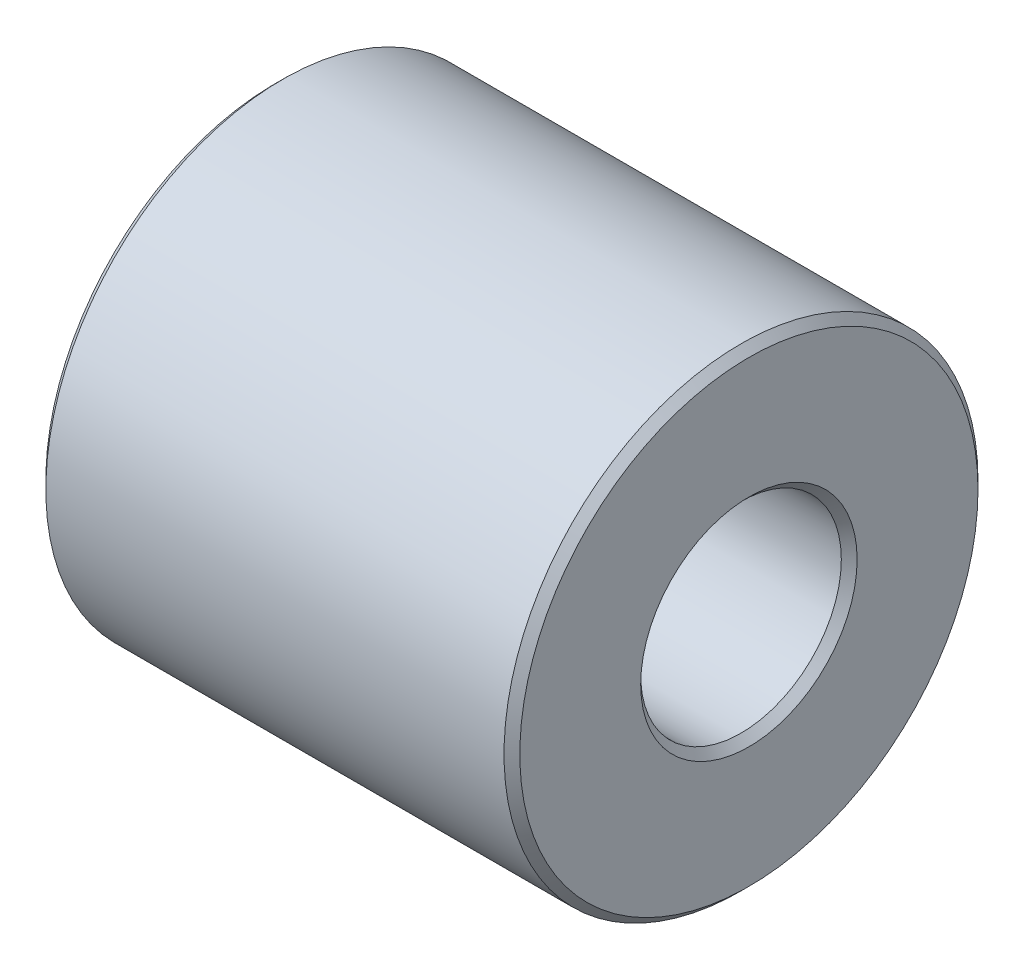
ISO-10303-21;
HEADER;
FILE_DESCRIPTION(('STEP AP214'),'2;1');
FILE_NAME('part.step','',(''),(''),'','','');
FILE_SCHEMA(('AUTOMOTIVE_DESIGN { 1 0 10303 214 1 1 1 1 }'));
ENDSEC;
DATA;
#1=APPLICATION_CONTEXT('core data for automotive mechanical design processes');
#2=APPLICATION_PROTOCOL_DEFINITION('international standard','automotive_design',2000,#1);
#3=PRODUCT_CONTEXT('',#1,'mechanical');
#4=PRODUCT('Part','Part','',(#3));
#5=PRODUCT_RELATED_PRODUCT_CATEGORY('part','',(#4));
#6=PRODUCT_DEFINITION_FORMATION('','',#4);
#7=PRODUCT_DEFINITION_CONTEXT('part definition',#1,'design');
#8=PRODUCT_DEFINITION('design','',#6,#7);
#9=PRODUCT_DEFINITION_SHAPE('','',#8);
#10=(LENGTH_UNIT() NAMED_UNIT(*) SI_UNIT(.MILLI.,.METRE.));
#11=(NAMED_UNIT(*) PLANE_ANGLE_UNIT() SI_UNIT($,.RADIAN.));
#12=(NAMED_UNIT(*) SI_UNIT($,.STERADIAN.) SOLID_ANGLE_UNIT());
#13=UNCERTAINTY_MEASURE_WITH_UNIT(LENGTH_MEASURE(1.E-05),#10,'distance_accuracy_value','');
#14=(GEOMETRIC_REPRESENTATION_CONTEXT(3) GLOBAL_UNCERTAINTY_ASSIGNED_CONTEXT((#13)) GLOBAL_UNIT_ASSIGNED_CONTEXT((#10,
#11,#12)) REPRESENTATION_CONTEXT('',''));
#15=CARTESIAN_POINT('',(0.,0.,0.));
#16=DIRECTION('',(0.,0.,1.));
#17=DIRECTION('',(1.,0.,0.));
#18=AXIS2_PLACEMENT_3D('',#15,#16,#17);
#19=CARTESIAN_POINT('',(30.,0.,0.));
#20=DIRECTION('',(1.,0.,0.));
#21=DIRECTION('',(0.,0.,-1.));
#22=AXIS2_PLACEMENT_3D('',#19,#20,#21);
#23=PLANE('',#22);
#24=CARTESIAN_POINT('',(30.,0.,0.));
#25=DIRECTION('',(1.,0.,0.));
#26=DIRECTION('',(0.,0.,-1.));
#27=AXIS2_PLACEMENT_3D('',#24,#25,#26);
#28=CIRCLE('',#27,14.5);
#29=CARTESIAN_POINT('',(30.,0.,-14.5));
#30=VERTEX_POINT('',#29);
#31=EDGE_CURVE('E40',#30,#30,#28,.T.);
#32=ORIENTED_EDGE('',*,*,#31,.T.);
#33=EDGE_LOOP('',(#32));
#34=FACE_BOUND('',#33,.T.);
#35=CARTESIAN_POINT('',(30.,0.,0.));
#36=DIRECTION('',(1.,0.,0.));
#37=DIRECTION('',(0.,0.,-1.));
#38=AXIS2_PLACEMENT_3D('',#35,#36,#37);
#39=CIRCLE('',#38,6.85);
#40=CARTESIAN_POINT('',(30.,0.,-6.85));
#41=VERTEX_POINT('',#40);
#42=EDGE_CURVE('E44',#41,#41,#39,.F.);
#43=ORIENTED_EDGE('',*,*,#42,.T.);
#44=EDGE_LOOP('',(#43));
#45=FACE_BOUND('',#44,.T.);
#46=ADVANCED_FACE('F29',(#34,#45),#23,.T.);
#47=CARTESIAN_POINT('',(0.,0.,0.));
#48=DIRECTION('',(1.,0.,0.));
#49=DIRECTION('',(0.,0.,-1.));
#50=AXIS2_PLACEMENT_3D('',#47,#48,#49);
#51=PLANE('',#50);
#52=CARTESIAN_POINT('',(0.,0.,0.));
#53=DIRECTION('',(1.,0.,0.));
#54=DIRECTION('',(0.,0.,-1.));
#55=AXIS2_PLACEMENT_3D('',#52,#53,#54);
#56=CIRCLE('',#55,14.5);
#57=CARTESIAN_POINT('',(0.,0.,-14.5));
#58=VERTEX_POINT('',#57);
#59=EDGE_CURVE('E49',#58,#58,#56,.F.);
#60=ORIENTED_EDGE('',*,*,#59,.T.);
#61=EDGE_LOOP('',(#60));
#62=FACE_BOUND('',#61,.T.);
#63=CARTESIAN_POINT('',(0.,0.,0.));
#64=DIRECTION('',(1.,0.,0.));
#65=DIRECTION('',(0.,0.,-1.));
#66=AXIS2_PLACEMENT_3D('',#63,#64,#65);
#67=CIRCLE('',#66,6.85);
#68=CARTESIAN_POINT('',(0.,0.,-6.85));
#69=VERTEX_POINT('',#68);
#70=EDGE_CURVE('E52',#69,#69,#67,.T.);
#71=ORIENTED_EDGE('',*,*,#70,.T.);
#72=EDGE_LOOP('',(#71));
#73=FACE_BOUND('',#72,.T.);
#74=ADVANCED_FACE('F74',(#62,#73),#51,.F.);
#75=CARTESIAN_POINT('',(30.,0.,0.));
#76=DIRECTION('',(-1.,0.,0.));
#77=DIRECTION('',(0.,0.,1.));
#78=AXIS2_PLACEMENT_3D('',#75,#76,#77);
#79=CYLINDRICAL_SURFACE('',#78,15.);
#80=CARTESIAN_POINT('',(0.5,0.,0.));
#81=DIRECTION('',(1.,0.,0.));
#82=DIRECTION('',(0.,0.,-1.));
#83=AXIS2_PLACEMENT_3D('',#80,#81,#82);
#84=CIRCLE('',#83,15.);
#85=CARTESIAN_POINT('',(0.5,0.,-15.));
#86=VERTEX_POINT('',#85);
#87=EDGE_CURVE('E55',#86,#86,#84,.T.);
#88=ORIENTED_EDGE('',*,*,#87,.T.);
#89=EDGE_LOOP('',(#88));
#90=FACE_BOUND('',#89,.T.);
#91=CARTESIAN_POINT('',(29.5,0.,0.));
#92=DIRECTION('',(1.,0.,0.));
#93=DIRECTION('',(0.,0.,-1.));
#94=AXIS2_PLACEMENT_3D('',#91,#92,#93);
#95=CIRCLE('',#94,15.);
#96=CARTESIAN_POINT('',(29.5,0.,-15.));
#97=VERTEX_POINT('',#96);
#98=EDGE_CURVE('E58',#97,#97,#95,.F.);
#99=ORIENTED_EDGE('',*,*,#98,.T.);
#100=EDGE_LOOP('',(#99));
#101=FACE_BOUND('',#100,.T.);
#102=ADVANCED_FACE('F62',(#90,#101),#79,.T.);
#103=CARTESIAN_POINT('',(30.,0.,0.));
#104=DIRECTION('',(-1.,0.,0.));
#105=DIRECTION('',(0.,0.,1.));
#106=AXIS2_PLACEMENT_3D('',#103,#104,#105);
#107=CYLINDRICAL_SURFACE('',#106,6.35);
#108=CARTESIAN_POINT('',(0.5,0.,0.));
#109=DIRECTION('',(1.,0.,0.));
#110=DIRECTION('',(0.,0.,-1.));
#111=AXIS2_PLACEMENT_3D('',#108,#109,#110);
#112=CIRCLE('',#111,6.35);
#113=CARTESIAN_POINT('',(0.5,0.,-6.35));
#114=VERTEX_POINT('',#113);
#115=EDGE_CURVE('E10',#114,#114,#112,.F.);
#116=ORIENTED_EDGE('',*,*,#115,.T.);
#117=EDGE_LOOP('',(#116));
#118=FACE_BOUND('',#117,.T.);
#119=CARTESIAN_POINT('',(29.5,0.,0.));
#120=DIRECTION('',(1.,0.,0.));
#121=DIRECTION('',(0.,0.,-1.));
#122=AXIS2_PLACEMENT_3D('',#119,#120,#121);
#123=CIRCLE('',#122,6.35);
#124=CARTESIAN_POINT('',(29.5,0.,-6.35));
#125=VERTEX_POINT('',#124);
#126=EDGE_CURVE('E36',#125,#125,#123,.T.);
#127=ORIENTED_EDGE('',*,*,#126,.T.);
#128=EDGE_LOOP('',(#127));
#129=FACE_BOUND('',#128,.T.);
#130=ADVANCED_FACE('F90',(#118,#129),#107,.F.);
#131=CARTESIAN_POINT('',(0.5,0.,0.));
#132=DIRECTION('',(1.,0.,0.));
#133=DIRECTION('',(0.,0.,-1.));
#134=AXIS2_PLACEMENT_3D('',#131,#132,#133);
#135=CONICAL_SURFACE('',#134,15.,0.785398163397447);
#136=ORIENTED_EDGE('',*,*,#59,.F.);
#137=EDGE_LOOP('',(#136));
#138=FACE_BOUND('',#137,.T.);
#139=ORIENTED_EDGE('',*,*,#87,.F.);
#140=EDGE_LOOP('',(#139));
#141=FACE_BOUND('',#140,.T.);
#142=ADVANCED_FACE('F68',(#138,#141),#135,.T.);
#143=CARTESIAN_POINT('',(30.,0.,0.));
#144=DIRECTION('',(-1.,0.,0.));
#145=DIRECTION('',(0.,0.,1.));
#146=AXIS2_PLACEMENT_3D('',#143,#144,#145);
#147=CONICAL_SURFACE('',#146,14.5,0.785398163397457);
#148=ORIENTED_EDGE('',*,*,#98,.F.);
#149=EDGE_LOOP('',(#148));
#150=FACE_BOUND('',#149,.T.);
#151=ORIENTED_EDGE('',*,*,#31,.F.);
#152=EDGE_LOOP('',(#151));
#153=FACE_BOUND('',#152,.T.);
#154=ADVANCED_FACE('F64',(#150,#153),#147,.T.);
#155=CARTESIAN_POINT('',(0.,0.,0.));
#156=DIRECTION('',(-1.,0.,0.));
#157=DIRECTION('',(0.,0.,1.));
#158=AXIS2_PLACEMENT_3D('',#155,#156,#157);
#159=CONICAL_SURFACE('',#158,6.85,0.785398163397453);
#160=ORIENTED_EDGE('',*,*,#115,.F.);
#161=EDGE_LOOP('',(#160));
#162=FACE_BOUND('',#161,.T.);
#163=ORIENTED_EDGE('',*,*,#70,.F.);
#164=EDGE_LOOP('',(#163));
#165=FACE_BOUND('',#164,.T.);
#166=ADVANCED_FACE('F67',(#162,#165),#159,.F.);
#167=CARTESIAN_POINT('',(29.5,0.,0.));
#168=DIRECTION('',(1.,0.,0.));
#169=DIRECTION('',(0.,0.,-1.));
#170=AXIS2_PLACEMENT_3D('',#167,#168,#169);
#171=CONICAL_SURFACE('',#170,6.35,0.785398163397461);
#172=ORIENTED_EDGE('',*,*,#42,.F.);
#173=EDGE_LOOP('',(#172));
#174=FACE_BOUND('',#173,.T.);
#175=ORIENTED_EDGE('',*,*,#126,.F.);
#176=EDGE_LOOP('',(#175));
#177=FACE_BOUND('',#176,.T.);
#178=ADVANCED_FACE('F31',(#174,#177),#171,.F.);
#179=CLOSED_SHELL('',(#46,#74,#102,#130,#142,#154,#166,#178));
#180=MANIFOLD_SOLID_BREP('B2',#179);
#181=ADVANCED_BREP_SHAPE_REPRESENTATION('',(#18,#180),#14);
#182=SHAPE_DEFINITION_REPRESENTATION(#9,#181);
ENDSEC;
END-ISO-10303-21;
